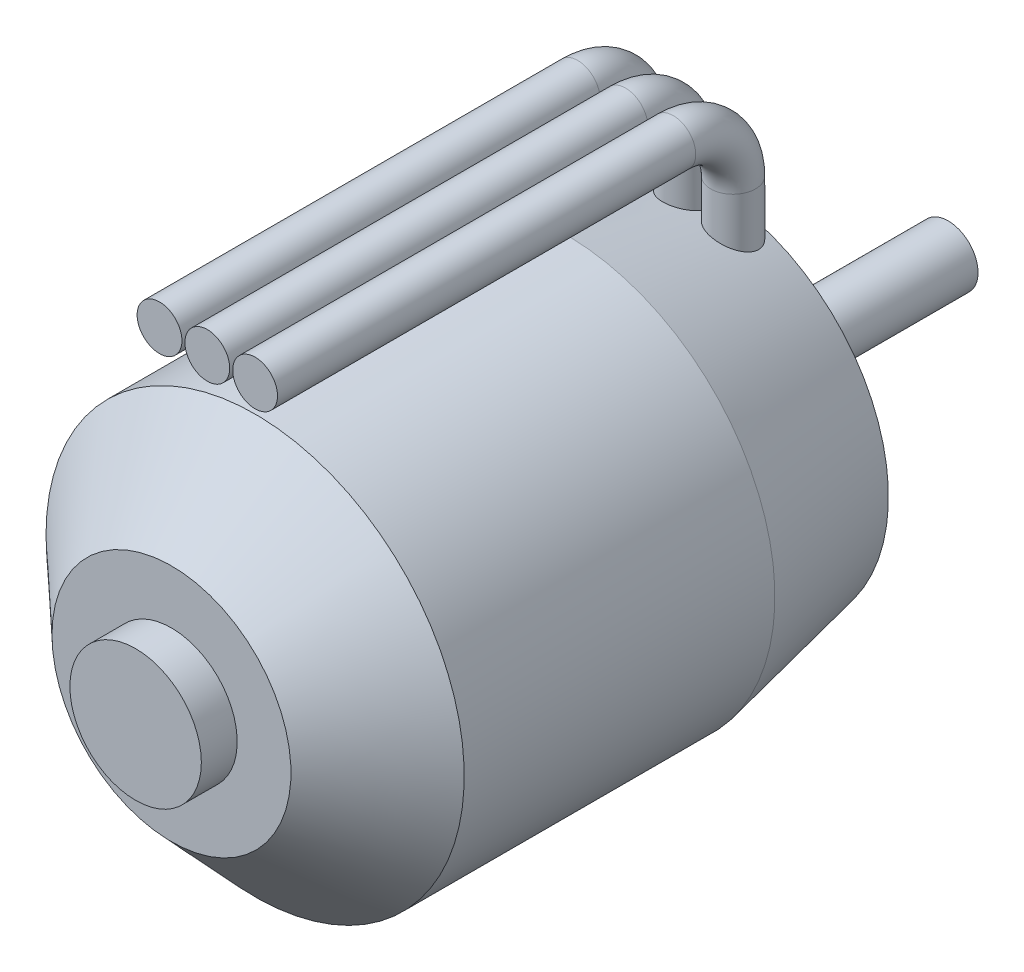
ISO-10303-21;
HEADER;
FILE_DESCRIPTION(('STEP AP214'),'2;1');
FILE_NAME('part.step','',(''),(''),'','','');
FILE_SCHEMA(('AUTOMOTIVE_DESIGN { 1 0 10303 214 1 1 1 1 }'));
ENDSEC;
DATA;
#1=APPLICATION_CONTEXT('core data for automotive mechanical design processes');
#2=APPLICATION_PROTOCOL_DEFINITION('international standard','automotive_design',2000,#1);
#3=PRODUCT_CONTEXT('',#1,'mechanical');
#4=PRODUCT('Part','Part','',(#3));
#5=PRODUCT_RELATED_PRODUCT_CATEGORY('part','',(#4));
#6=PRODUCT_DEFINITION_FORMATION('','',#4);
#7=PRODUCT_DEFINITION_CONTEXT('part definition',#1,'design');
#8=PRODUCT_DEFINITION('design','',#6,#7);
#9=PRODUCT_DEFINITION_SHAPE('','',#8);
#10=(LENGTH_UNIT() NAMED_UNIT(*) SI_UNIT(.MILLI.,.METRE.));
#11=(NAMED_UNIT(*) PLANE_ANGLE_UNIT() SI_UNIT($,.RADIAN.));
#12=(NAMED_UNIT(*) SI_UNIT($,.STERADIAN.) SOLID_ANGLE_UNIT());
#13=UNCERTAINTY_MEASURE_WITH_UNIT(LENGTH_MEASURE(1.E-05),#10,'distance_accuracy_value','');
#14=(GEOMETRIC_REPRESENTATION_CONTEXT(3) GLOBAL_UNCERTAINTY_ASSIGNED_CONTEXT((#13)) GLOBAL_UNIT_ASSIGNED_CONTEXT((#10,
#11,#12)) REPRESENTATION_CONTEXT('',''));
#15=CARTESIAN_POINT('',(0.,0.,0.));
#16=DIRECTION('',(0.,0.,1.));
#17=DIRECTION('',(1.,0.,0.));
#18=AXIS2_PLACEMENT_3D('',#15,#16,#17);
#19=CARTESIAN_POINT('',(0.,0.,-12.));
#20=DIRECTION('',(0.,0.,1.));
#21=DIRECTION('',(1.,0.,0.));
#22=AXIS2_PLACEMENT_3D('',#19,#20,#21);
#23=CONICAL_SURFACE('',#22,15.,0.205395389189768);
#24=CARTESIAN_POINT('',(-1.30324198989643,15.0796160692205,-11.3480301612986));
#25=CARTESIAN_POINT('',(-1.22807733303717,15.0709173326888,-11.4206913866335));
#26=CARTESIAN_POINT('',(-1.14669727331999,15.0635005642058,-11.4871701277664));
#27=CARTESIAN_POINT('',(-0.973804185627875,15.0509154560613,-11.6057206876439));
#28=CARTESIAN_POINT('',(-0.882280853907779,15.045749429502,-11.6577776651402));
#29=CARTESIAN_POINT('',(-0.691781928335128,15.037338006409,-11.7458713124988));
#30=CARTESIAN_POINT('',(-0.592809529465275,15.0340917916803,-11.7819148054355));
#31=CARTESIAN_POINT('',(-0.390216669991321,15.029244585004,-11.8369468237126));
#32=CARTESIAN_POINT('',(-0.286597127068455,15.0276432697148,-11.8559387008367));
#33=CARTESIAN_POINT('',(-0.0775942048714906,15.0259265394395,-11.8763346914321));
#34=CARTESIAN_POINT('',(0.0277897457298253,15.0258116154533,-11.8777329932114));
#35=CARTESIAN_POINT('',(0.237301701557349,15.0270570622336,-11.8628854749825));
#36=CARTESIAN_POINT('',(0.341429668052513,15.0284174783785,-11.8466391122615));
#37=CARTESIAN_POINT('',(0.545504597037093,15.0327504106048,-11.7969645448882));
#38=CARTESIAN_POINT('',(0.64545019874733,15.0357234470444,-11.7635307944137));
#39=CARTESIAN_POINT('',(0.838282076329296,15.0435407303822,-11.6804550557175));
#40=CARTESIAN_POINT('',(0.931168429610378,15.0483849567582,-11.6308132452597));
#41=CARTESIAN_POINT('',(1.10718859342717,15.0602717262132,-11.5168208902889));
#42=CARTESIAN_POINT('',(1.1903284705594,15.067312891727,-11.4524795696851));
#43=CARTESIAN_POINT('',(1.34457927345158,15.0839272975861,-11.3109861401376));
#44=CARTESIAN_POINT('',(1.41569047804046,15.0935004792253,-11.233834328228));
#45=CARTESIAN_POINT('',(1.54394656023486,15.1154407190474,-11.069000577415));
#46=CARTESIAN_POINT('',(1.60108735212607,15.1278085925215,-10.9813155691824));
#47=CARTESIAN_POINT('',(1.69988056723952,15.1554488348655,-10.7980412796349));
#48=CARTESIAN_POINT('',(1.74153269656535,15.1707212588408,-10.7024518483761));
#49=CARTESIAN_POINT('',(1.80861151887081,15.2042080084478,-10.5054292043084));
#50=CARTESIAN_POINT('',(1.83391659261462,15.2224431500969,-10.403958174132));
#51=CARTESIAN_POINT('',(1.86733935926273,15.2614599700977,-10.198706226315));
#52=CARTESIAN_POINT('',(1.87545532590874,15.2822419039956,-10.0949250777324));
#53=CARTESIAN_POINT('',(1.87449591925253,15.326243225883,-9.8858461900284));
#54=CARTESIAN_POINT('',(1.86508163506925,15.3495022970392,-9.78055842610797));
#55=CARTESIAN_POINT('',(1.82883776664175,15.3973390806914,-9.57333055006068));
#56=CARTESIAN_POINT('',(1.80200548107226,15.4219169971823,-9.4713909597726));
#57=CARTESIAN_POINT('',(1.73088855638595,15.4720370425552,-9.27116488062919));
#58=CARTESIAN_POINT('',(1.68620659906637,15.4975882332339,-9.17302158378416));
#59=CARTESIAN_POINT('',(1.58060843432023,15.547946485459,-8.9856692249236));
#60=CARTESIAN_POINT('',(1.51969068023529,15.5727534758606,-8.89646101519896));
#61=CARTESIAN_POINT('',(1.38275782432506,15.6205278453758,-8.72902997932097));
#62=CARTESIAN_POINT('',(1.30666069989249,15.643484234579,-8.65087096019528));
#63=CARTESIAN_POINT('',(1.14153413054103,15.686125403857,-8.50855830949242));
#64=CARTESIAN_POINT('',(1.05250661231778,15.7058106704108,-8.44440259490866));
#65=CARTESIAN_POINT('',(0.866596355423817,15.7402112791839,-8.33386601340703));
#66=CARTESIAN_POINT('',(0.770002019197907,15.7550499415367,-8.28703923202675));
#67=CARTESIAN_POINT('',(0.569664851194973,15.7795360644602,-8.210419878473));
#68=CARTESIAN_POINT('',(0.465924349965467,15.7891852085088,-8.18062178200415));
#69=CARTESIAN_POINT('',(0.259321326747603,15.8023256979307,-8.14017418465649));
#70=CARTESIAN_POINT('',(0.156633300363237,15.8060770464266,-8.12871573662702));
#71=CARTESIAN_POINT('',(-0.0492740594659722,15.8080037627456,-8.12282137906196));
#72=CARTESIAN_POINT('',(-0.152493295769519,15.8061801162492,-8.12838246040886));
#73=CARTESIAN_POINT('',(-0.353774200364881,15.7971963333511,-8.15594803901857));
#74=CARTESIAN_POINT('',(-0.451900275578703,15.7901730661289,-8.17753083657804));
#75=CARTESIAN_POINT('',(-0.643039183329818,15.7713787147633,-8.23588198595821));
#76=CARTESIAN_POINT('',(-0.736051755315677,15.7596073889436,-8.27265111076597));
#77=CARTESIAN_POINT('',(-0.915942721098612,15.7317821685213,-8.36083487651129));
#78=CARTESIAN_POINT('',(-1.00270571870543,15.7156656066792,-8.41246464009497));
#79=CARTESIAN_POINT('',(-1.16641342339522,15.6801149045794,-8.52854497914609));
#80=CARTESIAN_POINT('',(-1.24335615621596,15.6606800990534,-8.59299812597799));
#81=CARTESIAN_POINT('',(-1.38871897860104,15.6185834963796,-8.73591627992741));
#82=CARTESIAN_POINT('',(-1.45663938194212,15.5958198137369,-8.8148595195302));
#83=CARTESIAN_POINT('',(-1.5783671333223,15.5488492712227,-8.98258844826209));
#84=CARTESIAN_POINT('',(-1.63217141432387,15.5246420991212,-9.07137627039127));
#85=CARTESIAN_POINT('',(-1.72612643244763,15.4749463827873,-9.25998649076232));
#86=CARTESIAN_POINT('',(-1.76569221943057,15.4494437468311,-9.36009715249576));
#87=CARTESIAN_POINT('',(-1.82718127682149,15.3991444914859,-9.56577062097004));
#88=CARTESIAN_POINT('',(-1.84910388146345,15.3743478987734,-9.67133363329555));
#89=CARTESIAN_POINT('',(-1.87465828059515,15.326232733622,-9.88583911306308));
#90=CARTESIAN_POINT('',(-1.87815166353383,15.3029266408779,-9.99480098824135));
#91=CARTESIAN_POINT('',(-1.86613050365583,15.258768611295,-10.2122039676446));
#92=CARTESIAN_POINT('',(-1.85061389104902,15.2379169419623,-10.3206450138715));
#93=CARTESIAN_POINT('',(-1.8012472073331,15.1995632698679,-10.5316545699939));
#94=CARTESIAN_POINT('',(-1.76774867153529,15.182005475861,-10.6342952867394));
#95=CARTESIAN_POINT('',(-1.68343019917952,15.1500124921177,-10.8326281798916));
#96=CARTESIAN_POINT('',(-1.63263141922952,15.1355735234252,-10.9283286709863));
#97=CARTESIAN_POINT('',(-1.535304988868,15.1142119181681,-11.0786677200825));
#98=CARTESIAN_POINT('',(-1.4932738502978,15.1064087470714,-11.1361434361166));
#99=CARTESIAN_POINT('',(-1.40287263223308,15.0920770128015,-11.246047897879));
#100=CARTESIAN_POINT('',(-1.35450268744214,15.08554842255,-11.2984767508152));
#101=CARTESIAN_POINT('',(-1.30324198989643,15.0796160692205,-11.3480301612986));
#102=B_SPLINE_CURVE_WITH_KNOTS('',3,(#24,#25,#26,#27,#28,#29,#30,#31,#32,#33,#34,#35,#36,#37,
#38,#39,#40,#41,#42,#43,#44,#45,#46,#47,#48,#49,#50,#51,#52,#53,#54,#55,#56,#57,#58,#59,#60,#61,
#62,#63,#64,#65,#66,#67,#68,#69,#70,#71,#72,#73,#74,#75,#76,#77,#78,#79,#80,#81,#82,#83,#84,#85,
#86,#87,#88,#89,#90,#91,#92,#93,#94,#95,#96,#97,#98,#99,#100,#101),.UNSPECIFIED.,.T.,.F.,(4,2,2,
2,2,2,2,2,2,2,2,2,2,2,2,2,2,2,2,2,2,2,2,2,2,2,2,2,2,2,2,2,2,2,2,2,2,2,4),(0.,0.314454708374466,
0.629231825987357,0.943874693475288,1.25845569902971,1.57314061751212,1.88783521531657,
2.20263141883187,2.51742416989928,2.83201992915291,3.14660839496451,3.46128875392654,
3.77597508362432,4.09297645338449,4.41000965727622,4.73323575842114,5.05651200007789,
5.38742529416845,5.71837012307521,6.05115419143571,6.3838887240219,6.70734147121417,
7.03068922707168,7.33933694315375,7.64793009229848,7.94867668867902,8.24943859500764,
8.55479445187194,8.86021160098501,9.17857846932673,9.49701445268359,9.82734279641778,
10.1576836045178,10.4905019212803,10.8233564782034,11.1499290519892,11.4761036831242,
11.6905596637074,11.9050110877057),.UNSPECIFIED.);
#103=CARTESIAN_POINT('',(-1.30324198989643,15.0796160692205,-11.3480301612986));
#104=VERTEX_POINT('',#103);
#105=EDGE_CURVE('E174',#104,#104,#102,.T.);
#106=ORIENTED_EDGE('',*,*,#105,.T.);
#107=EDGE_LOOP('',(#106));
#108=FACE_BOUND('',#107,.T.);
#109=CARTESIAN_POINT('',(0.,0.,0.));
#110=DIRECTION('',(0.,0.,-1.));
#111=DIRECTION('',(-1.,0.,0.));
#112=AXIS2_PLACEMENT_3D('',#109,#110,#111);
#113=CIRCLE('',#112,17.5);
#114=CARTESIAN_POINT('',(-17.5,0.,0.));
#115=VERTEX_POINT('',#114);
#116=EDGE_CURVE('E160',#115,#115,#113,.T.);
#117=ORIENTED_EDGE('',*,*,#116,.T.);
#118=EDGE_LOOP('',(#117));
#119=FACE_BOUND('',#118,.T.);
#120=CARTESIAN_POINT('',(0.,0.,-12.));
#121=DIRECTION('',(0.,0.,-1.));
#122=DIRECTION('',(-1.,0.,0.));
#123=AXIS2_PLACEMENT_3D('',#120,#121,#122);
#124=CIRCLE('',#123,15.);
#125=CARTESIAN_POINT('',(-15.,0.,-12.));
#126=VERTEX_POINT('',#125);
#127=EDGE_CURVE('E153',#126,#126,#124,.T.);
#128=ORIENTED_EDGE('',*,*,#127,.F.);
#129=EDGE_LOOP('',(#128));
#130=FACE_BOUND('',#129,.T.);
#131=CARTESIAN_POINT('',(-5.37809344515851,14.1651981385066,-11.2714100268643));
#132=CARTESIAN_POINT('',(-5.30746011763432,14.1749557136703,-11.3479619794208));
#133=CARTESIAN_POINT('',(-5.23056754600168,14.1879261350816,-11.4184580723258));
#134=CARTESIAN_POINT('',(-5.0667938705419,14.2191565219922,-11.5454296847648));
#135=CARTESIAN_POINT('',(-4.97989476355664,14.2374261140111,-11.6018793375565));
#136=CARTESIAN_POINT('',(-4.79904999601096,14.2779830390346,-11.699310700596));
#137=CARTESIAN_POINT('',(-4.70512646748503,14.3002580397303,-11.7403387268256));
#138=CARTESIAN_POINT('',(-4.51258865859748,14.3477411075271,-11.8064443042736));
#139=CARTESIAN_POINT('',(-4.41397562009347,14.3729484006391,-11.8315260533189));
#140=CARTESIAN_POINT('',(-4.21017206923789,14.4264761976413,-11.8661703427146));
#141=CARTESIAN_POINT('',(-4.10488187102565,14.4548843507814,-11.8750118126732));
#142=CARTESIAN_POINT('',(-3.89464018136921,14.5129488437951,-11.8749881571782));
#143=CARTESIAN_POINT('',(-3.78968877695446,14.5426054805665,-11.8661187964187));
#144=CARTESIAN_POINT('',(-3.57918112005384,14.6035330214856,-11.8303915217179));
#145=CARTESIAN_POINT('',(-3.47373732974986,14.6348237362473,-11.8029019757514));
#146=CARTESIAN_POINT('',(-3.26918167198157,14.6974064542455,-11.7301204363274));
#147=CARTESIAN_POINT('',(-3.17007025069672,14.7286984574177,-11.6848271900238));
#148=CARTESIAN_POINT('',(-2.98009850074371,14.7911948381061,-11.5771699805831));
#149=CARTESIAN_POINT('',(-2.88933311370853,14.8223950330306,-11.5146358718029));
#150=CARTESIAN_POINT('',(-2.71999438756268,14.8840795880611,-11.3745136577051));
#151=CARTESIAN_POINT('',(-2.64142095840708,14.9145639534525,-11.2969256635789));
#152=CARTESIAN_POINT('',(-2.49922337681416,14.9744543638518,-11.1293029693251));
#153=CARTESIAN_POINT('',(-2.43554020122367,15.0038642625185,-11.0393197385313));
#154=CARTESIAN_POINT('',(-2.32477001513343,15.0614829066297,-10.8493067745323));
#155=CARTESIAN_POINT('',(-2.27768254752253,15.089691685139,-10.7492773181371));
#156=CARTESIAN_POINT('',(-2.20209846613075,15.1442869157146,-10.5432239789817));
#157=CARTESIAN_POINT('',(-2.17341159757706,15.1706894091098,-10.4372741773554));
#158=CARTESIAN_POINT('',(-2.13491269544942,15.2215422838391,-10.2215357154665));
#159=CARTESIAN_POINT('',(-2.1250996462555,15.2459927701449,-10.1117472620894));
#160=CARTESIAN_POINT('',(-2.12490353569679,15.2919308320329,-9.89347882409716));
#161=CARTESIAN_POINT('',(-2.13419264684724,15.3134617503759,-9.78500836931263));
#162=CARTESIAN_POINT('',(-2.17156456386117,15.3532931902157,-9.57073219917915));
#163=CARTESIAN_POINT('',(-2.19964496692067,15.3715941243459,-9.46492614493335));
#164=CARTESIAN_POINT('',(-2.27301500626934,15.4036208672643,-9.26213176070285));
#165=CARTESIAN_POINT('',(-2.31780165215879,15.4174602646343,-9.16497962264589));
#166=CARTESIAN_POINT('',(-2.42355223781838,15.4403494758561,-8.97929261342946));
#167=CARTESIAN_POINT('',(-2.48451203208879,15.4494005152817,-8.89075554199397));
#168=CARTESIAN_POINT('',(-2.61826502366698,15.4615994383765,-8.72835888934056));
#169=CARTESIAN_POINT('',(-2.69051155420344,15.4649614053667,-8.65406511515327));
#170=CARTESIAN_POINT('',(-2.84626872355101,15.4657951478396,-8.51838318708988));
#171=CARTESIAN_POINT('',(-2.92977644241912,15.4632684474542,-8.45699169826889));
#172=CARTESIAN_POINT('',(-3.10254530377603,15.452099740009,-8.35071234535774));
#173=CARTESIAN_POINT('',(-3.19152776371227,15.4436611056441,-8.30534906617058));
#174=CARTESIAN_POINT('',(-3.37488433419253,15.4208086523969,-8.22949210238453));
#175=CARTESIAN_POINT('',(-3.46925815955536,15.4063951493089,-8.19899763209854));
#176=CARTESIAN_POINT('',(-3.66063444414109,15.3718252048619,-8.15334378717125));
#177=CARTESIAN_POINT('',(-3.75763769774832,15.3516670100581,-8.13818910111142));
#178=CARTESIAN_POINT('',(-3.95158799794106,15.3061378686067,-8.12310118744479));
#179=CARTESIAN_POINT('',(-4.04853503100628,15.2807659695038,-8.12317074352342));
#180=CARTESIAN_POINT('',(-4.24457607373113,15.2242356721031,-8.13829919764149));
#181=CARTESIAN_POINT('',(-4.34355084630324,15.1928584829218,-8.1540751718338));
#182=CARTESIAN_POINT('',(-4.53652126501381,15.1262288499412,-8.20065761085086));
#183=CARTESIAN_POINT('',(-4.63051520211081,15.0909750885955,-8.23146919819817));
#184=CARTESIAN_POINT('',(-4.81891317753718,15.014755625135,-8.30995893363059));
#185=CARTESIAN_POINT('',(-4.9127412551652,14.9735585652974,-8.35879506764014));
#186=CARTESIAN_POINT('',(-5.09037373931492,14.8894004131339,-8.47102665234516));
#187=CARTESIAN_POINT('',(-5.17417399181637,14.8464385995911,-8.53442810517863));
#188=CARTESIAN_POINT('',(-5.33551372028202,14.7572000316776,-8.67917245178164));
#189=CARTESIAN_POINT('',(-5.41219149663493,14.7109036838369,-8.76146698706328));
#190=CARTESIAN_POINT('',(-5.55001063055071,14.6199112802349,-8.93899859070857));
#191=CARTESIAN_POINT('',(-5.61114802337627,14.5752156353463,-9.03423895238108));
#192=CARTESIAN_POINT('',(-5.7162021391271,14.4891086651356,-9.23624043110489));
#193=CARTESIAN_POINT('',(-5.75998590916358,14.4477245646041,-9.34308279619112));
#194=CARTESIAN_POINT('',(-5.82749661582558,14.3707703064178,-9.56491484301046));
#195=CARTESIAN_POINT('',(-5.85123490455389,14.3351968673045,-9.67989987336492));
#196=CARTESIAN_POINT('',(-5.8757987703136,14.2743044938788,-9.90561492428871));
#197=CARTESIAN_POINT('',(-5.87821060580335,14.248416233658,-10.0160163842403));
#198=CARTESIAN_POINT('',(-5.86323656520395,14.2047675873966,-10.2371102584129));
#199=CARTESIAN_POINT('',(-5.84586161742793,14.1870027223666,-10.3478024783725));
#200=CARTESIAN_POINT('',(-5.79401629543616,14.1617651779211,-10.5543676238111));
#201=CARTESIAN_POINT('',(-5.76143224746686,14.1534399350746,-10.650614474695));
#202=CARTESIAN_POINT('',(-5.68097965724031,14.144138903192,-10.8367658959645));
#203=CARTESIAN_POINT('',(-5.63313496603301,14.1431517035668,-10.9266800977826));
#204=CARTESIAN_POINT('',(-5.5488697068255,14.1469426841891,-11.0581335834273));
#205=CARTESIAN_POINT('',(-5.51728598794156,14.1492824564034,-11.1029331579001));
#206=CARTESIAN_POINT('',(-5.45040539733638,14.1558535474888,-11.18951266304));
#207=CARTESIAN_POINT('',(-5.41510890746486,14.160084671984,-11.2312929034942));
#208=CARTESIAN_POINT('',(-5.37809344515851,14.1651981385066,-11.2714100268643));
#209=B_SPLINE_CURVE_WITH_KNOTS('',3,(#131,#132,#133,#134,#135,#136,#137,#138,#139,#140,#141,
#142,#143,#144,#145,#146,#147,#148,#149,#150,#151,#152,#153,#154,#155,#156,#157,#158,#159,#160,
#161,#162,#163,#164,#165,#166,#167,#168,#169,#170,#171,#172,#173,#174,#175,#176,#177,#178,#179,
#180,#181,#182,#183,#184,#185,#186,#187,#188,#189,#190,#191,#192,#193,#194,#195,#196,#197,#198,
#199,#200,#201,#202,#203,#204,#205,#206,#207,#208),.UNSPECIFIED.,.T.,.F.,(4,2,2,2,2,2,2,2,2,2,2,
2,2,2,2,2,2,2,2,2,2,2,2,2,2,2,2,2,2,2,2,2,2,2,2,2,2,2,4),(0.,0.313632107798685,
0.627837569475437,0.941091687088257,1.25426330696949,1.58103177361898,1.90787839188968,
2.24640745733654,2.58496034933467,2.92698192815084,3.26900098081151,3.60964041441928,
3.95027046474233,4.28731921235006,4.62434982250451,4.95564467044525,5.28689716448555,
5.60889016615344,5.93080071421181,6.24030362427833,6.54972643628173,6.84899661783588,
7.14825098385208,7.44759678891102,7.74699732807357,8.06072409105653,8.37455781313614,
8.71365237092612,9.05288691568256,9.41610886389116,9.77942338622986,10.1454699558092,
10.5113090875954,10.8496850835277,11.1878742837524,11.4921946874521,11.7960417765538,
11.9604178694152,12.124777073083),.UNSPECIFIED.);
#210=CARTESIAN_POINT('',(-5.37809344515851,14.1651981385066,-11.2714100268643));
#211=VERTEX_POINT('',#210);
#212=EDGE_CURVE('E83',#211,#211,#209,.T.);
#213=ORIENTED_EDGE('',*,*,#212,.T.);
#214=EDGE_LOOP('',(#213));
#215=FACE_BOUND('',#214,.T.);
#216=CARTESIAN_POINT('',(2.71356064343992,14.8871984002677,-11.3640743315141));
#217=CARTESIAN_POINT('',(2.7933818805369,14.8567082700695,-11.4393455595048));
#218=CARTESIAN_POINT('',(2.87980058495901,14.8257939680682,-11.5075718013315));
#219=CARTESIAN_POINT('',(3.0631545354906,14.7634027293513,-11.627881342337));
#220=CARTESIAN_POINT('',(3.16010255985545,14.7319251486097,-11.6799447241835));
#221=CARTESIAN_POINT('',(3.3614928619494,14.6688171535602,-11.7663315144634));
#222=CARTESIAN_POINT('',(3.46593056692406,14.6371868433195,-11.800665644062));
#223=CARTESIAN_POINT('',(3.67927088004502,14.5742906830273,-11.8506107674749));
#224=CARTESIAN_POINT('',(3.78817253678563,14.5430247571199,-11.866225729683));
#225=CARTESIAN_POINT('',(4.00743744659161,14.4815506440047,-11.8782000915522));
#226=CARTESIAN_POINT('',(4.11780189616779,14.4513434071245,-11.8745426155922));
#227=CARTESIAN_POINT('',(4.33673176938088,14.3929769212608,-11.847808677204));
#228=CARTESIAN_POINT('',(4.44529711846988,14.3648177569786,-11.8247314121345));
#229=CARTESIAN_POINT('',(4.65563051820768,14.312197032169,-11.7600226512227));
#230=CARTESIAN_POINT('',(4.75748141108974,14.287681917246,-11.7187050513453));
#231=CARTESIAN_POINT('',(4.95316474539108,14.2431568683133,-11.6183879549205));
#232=CARTESIAN_POINT('',(5.04699929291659,14.2231457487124,-11.559393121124));
#233=CARTESIAN_POINT('',(5.21939030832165,14.1898832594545,-11.4282488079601));
#234=CARTESIAN_POINT('',(5.29845269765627,14.1763620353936,-11.3568340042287));
#235=CARTESIAN_POINT('',(5.44369403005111,14.155988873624,-11.2011205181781));
#236=CARTESIAN_POINT('',(5.50987953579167,14.1491335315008,-11.1168284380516));
#237=CARTESIAN_POINT('',(5.62331227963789,14.1432521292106,-10.9436700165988));
#238=CARTESIAN_POINT('',(5.67149202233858,14.1437586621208,-10.8554294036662));
#239=CARTESIAN_POINT('',(5.75303827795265,14.1518956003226,-10.672671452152));
#240=CARTESIAN_POINT('',(5.78640850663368,14.1595242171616,-10.5781556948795));
#241=CARTESIAN_POINT('',(5.83671320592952,14.1814725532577,-10.3890566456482));
#242=CARTESIAN_POINT('',(5.8541608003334,14.1955595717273,-10.2945816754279));
#243=CARTESIAN_POINT('',(5.87446872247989,14.2298622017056,-10.1051956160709));
#244=CARTESIAN_POINT('',(5.87732734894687,14.2500785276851,-10.0102844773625));
#245=CARTESIAN_POINT('',(5.86879981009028,14.2966123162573,-9.81930074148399));
#246=CARTESIAN_POINT('',(5.85693758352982,14.3231100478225,-9.72329419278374));
#247=CARTESIAN_POINT('',(5.81909365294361,14.3807262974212,-9.5355618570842));
#248=CARTESIAN_POINT('',(5.79310712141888,14.4118463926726,-9.44383754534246));
#249=CARTESIAN_POINT('',(5.7252753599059,14.4804345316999,-9.25864431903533));
#250=CARTESIAN_POINT('',(5.68223717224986,14.5182200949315,-9.16573044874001));
#251=CARTESIAN_POINT('',(5.58228392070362,14.5963936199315,-8.98889640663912));
#252=CARTESIAN_POINT('',(5.52536268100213,14.6367827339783,-8.90498026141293));
#253=CARTESIAN_POINT('',(5.3933346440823,14.72247924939,-8.74049426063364));
#254=CARTESIAN_POINT('',(5.31704053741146,14.7678985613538,-8.66093289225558));
#255=CARTESIAN_POINT('',(5.15158028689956,14.8583380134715,-8.51622966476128));
#256=CARTESIAN_POINT('',(5.06240984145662,14.9033580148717,-8.45109264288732));
#257=CARTESIAN_POINT('',(4.86993176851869,14.9927931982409,-8.33509805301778));
#258=CARTESIAN_POINT('',(4.76624051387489,15.0371329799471,-8.28481544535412));
#259=CARTESIAN_POINT('',(4.54989115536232,15.1216420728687,-8.20373222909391));
#260=CARTESIAN_POINT('',(4.43723513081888,15.1618123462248,-8.17292711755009));
#261=CARTESIAN_POINT('',(4.21161234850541,15.2344783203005,-8.13362913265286));
#262=CARTESIAN_POINT('',(4.09890334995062,15.2672439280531,-8.12416585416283));
#263=CARTESIAN_POINT('',(3.87189024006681,15.3260041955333,-8.12594787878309));
#264=CARTESIAN_POINT('',(3.75758722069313,15.3520032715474,-8.13717963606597));
#265=CARTESIAN_POINT('',(3.54136277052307,15.3943263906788,-8.17891931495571));
#266=CARTESIAN_POINT('',(3.43922721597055,15.411293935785,-8.20767111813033));
#267=CARTESIAN_POINT('',(3.24051749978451,15.4383846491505,-8.28242489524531));
#268=CARTESIAN_POINT('',(3.14394112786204,15.4485105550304,-8.328419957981));
#269=CARTESIAN_POINT('',(2.96533755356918,15.4615489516,-8.43310596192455));
#270=CARTESIAN_POINT('',(2.88278181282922,15.4648646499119,-8.49084864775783));
#271=CARTESIAN_POINT('',(2.7279700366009,15.4658510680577,-8.61882381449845));
#272=CARTESIAN_POINT('',(2.65571319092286,15.4635222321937,-8.68905531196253));
#273=CARTESIAN_POINT('',(2.5240586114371,15.4538314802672,-8.83934327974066));
#274=CARTESIAN_POINT('',(2.46456090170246,15.4465107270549,-8.91931503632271));
#275=CARTESIAN_POINT('',(2.3591429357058,15.4275632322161,-9.08728518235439));
#276=CARTESIAN_POINT('',(2.31322422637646,15.4159360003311,-9.17528448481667));
#277=CARTESIAN_POINT('',(2.23485274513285,15.388707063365,-9.35954134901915));
#278=CARTESIAN_POINT('',(2.20282268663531,15.3730011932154,-9.45596312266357));
#279=CARTESIAN_POINT('',(2.15477511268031,15.3385304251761,-9.65218139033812));
#280=CARTESIAN_POINT('',(2.13875983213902,15.3197651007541,-9.75197835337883));
#281=CARTESIAN_POINT('',(2.12261084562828,15.2790596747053,-9.9561907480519));
#282=CARTESIAN_POINT('',(2.12310553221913,15.2570258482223,-10.0606372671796));
#283=CARTESIAN_POINT('',(2.14128695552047,15.21094425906,-10.2675951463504));
#284=CARTESIAN_POINT('',(2.15898010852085,15.1868957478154,-10.3701057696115));
#285=CARTESIAN_POINT('',(2.21169845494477,15.1364709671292,-10.5735765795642));
#286=CARTESIAN_POINT('',(2.24724633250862,15.1100455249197,-10.6743890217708));
#287=CARTESIAN_POINT('',(2.3347131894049,15.0559241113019,-10.8681735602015));
#288=CARTESIAN_POINT('',(2.38661580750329,15.0282294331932,-10.9611533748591));
#289=CARTESIAN_POINT('',(2.48455681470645,14.9816249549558,-11.1062790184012));
#290=CARTESIAN_POINT('',(2.52638914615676,14.9629985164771,-11.161405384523));
#291=CARTESIAN_POINT('',(2.61579853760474,14.9253700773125,-11.2666409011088));
#292=CARTESIAN_POINT('',(2.66337564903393,14.9063680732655,-11.3167500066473));
#293=CARTESIAN_POINT('',(2.71356064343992,14.8871984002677,-11.3640743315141));
#294=B_SPLINE_CURVE_WITH_KNOTS('',3,(#216,#217,#218,#219,#220,#221,#222,#223,#224,#225,#226,
#227,#228,#229,#230,#231,#232,#233,#234,#235,#236,#237,#238,#239,#240,#241,#242,#243,#244,#245,
#246,#247,#248,#249,#250,#251,#252,#253,#254,#255,#256,#257,#258,#259,#260,#261,#262,#263,#264,
#265,#266,#267,#268,#269,#270,#271,#272,#273,#274,#275,#276,#277,#278,#279,#280,#281,#282,#283,
#284,#285,#286,#287,#288,#289,#290,#291,#292,#293),.UNSPECIFIED.,.T.,.F.,(4,2,2,2,2,2,2,2,2,2,2,
2,2,2,2,2,2,2,2,2,2,2,2,2,2,2,2,2,2,2,2,2,2,2,2,2,2,2,4),(0.,0.341354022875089,
0.683127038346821,1.02469313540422,1.36618680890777,1.70797955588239,2.04978643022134,
2.38592750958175,2.72198000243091,3.04248862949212,3.36283347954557,3.66293353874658,
3.96295825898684,4.25293266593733,4.5429408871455,4.84257704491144,5.14231567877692,
5.46839498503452,5.7946196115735,6.15068916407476,6.50687794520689,6.87544603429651,
7.24392888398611,7.59528686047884,7.94641493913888,8.26709281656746,8.58764230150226,
8.88859172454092,9.18951745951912,9.48799132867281,9.78649918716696,10.0935448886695,
10.4006334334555,10.7194230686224,11.0383316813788,11.3671734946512,11.6956873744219,
11.9103006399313,12.1249158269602),.UNSPECIFIED.);
#295=CARTESIAN_POINT('',(2.71356064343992,14.8871984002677,-11.3640743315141));
#296=VERTEX_POINT('',#295);
#297=EDGE_CURVE('E44',#296,#296,#294,.T.);
#298=ORIENTED_EDGE('',*,*,#297,.T.);
#299=EDGE_LOOP('',(#298));
#300=FACE_BOUND('',#299,.T.);
#301=ADVANCED_FACE('F40',(#108,#119,#130,#215,#300),#23,.T.);
#302=CARTESIAN_POINT('',(0.,0.,-13.));
#303=DIRECTION('',(0.,0.,-1.));
#304=DIRECTION('',(-1.,0.,0.));
#305=AXIS2_PLACEMENT_3D('',#302,#303,#304);
#306=PLANE('',#305);
#307=CARTESIAN_POINT('',(0.,0.,-13.));
#308=DIRECTION('',(0.,0.,-1.));
#309=DIRECTION('',(-1.,0.,0.));
#310=AXIS2_PLACEMENT_3D('',#307,#308,#309);
#311=CIRCLE('',#310,3.5);
#312=CARTESIAN_POINT('',(-3.5,0.,-13.));
#313=VERTEX_POINT('',#312);
#314=EDGE_CURVE('E108',#313,#313,#311,.T.);
#315=ORIENTED_EDGE('',*,*,#314,.T.);
#316=EDGE_LOOP('',(#315));
#317=FACE_BOUND('',#316,.T.);
#318=CARTESIAN_POINT('',(0.,0.,-13.));
#319=DIRECTION('',(0.,0.,-1.));
#320=DIRECTION('',(-1.,0.,0.));
#321=AXIS2_PLACEMENT_3D('',#318,#319,#320);
#322=CIRCLE('',#321,2.5);
#323=CARTESIAN_POINT('',(-2.5,0.,-13.));
#324=VERTEX_POINT('',#323);
#325=EDGE_CURVE('E101',#324,#324,#322,.T.);
#326=ORIENTED_EDGE('',*,*,#325,.F.);
#327=EDGE_LOOP('',(#326));
#328=FACE_BOUND('',#327,.T.);
#329=ADVANCED_FACE('F143',(#317,#328),#306,.T.);
#330=CARTESIAN_POINT('',(0.,0.,-12.));
#331=DIRECTION('',(0.,0.,-1.));
#332=DIRECTION('',(-1.,0.,0.));
#333=AXIS2_PLACEMENT_3D('',#330,#331,#332);
#334=PLANE('',#333);
#335=CARTESIAN_POINT('',(8.83883476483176,8.83883476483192,-12.));
#336=DIRECTION('',(0.,0.,-1.));
#337=DIRECTION('',(-1.,0.,0.));
#338=AXIS2_PLACEMENT_3D('',#335,#336,#337);
#339=CIRCLE('',#338,1.24999999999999);
#340=CARTESIAN_POINT('',(7.58883476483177,8.83883476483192,-12.));
#341=VERTEX_POINT('',#340);
#342=EDGE_CURVE('E77',#341,#341,#339,.T.);
#343=ORIENTED_EDGE('',*,*,#342,.F.);
#344=EDGE_LOOP('',(#343));
#345=FACE_BOUND('',#344,.T.);
#346=CARTESIAN_POINT('',(-8.83883476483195,8.83883476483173,-12.));
#347=DIRECTION('',(0.,0.,-1.));
#348=DIRECTION('',(-1.,0.,0.));
#349=AXIS2_PLACEMENT_3D('',#346,#347,#348);
#350=CIRCLE('',#349,1.24999999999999);
#351=CARTESIAN_POINT('',(-10.0888347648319,8.83883476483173,-12.));
#352=VERTEX_POINT('',#351);
#353=EDGE_CURVE('E76',#352,#352,#350,.T.);
#354=ORIENTED_EDGE('',*,*,#353,.F.);
#355=EDGE_LOOP('',(#354));
#356=FACE_BOUND('',#355,.T.);
#357=CARTESIAN_POINT('',(-8.83883476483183,-8.83883476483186,-12.));
#358=DIRECTION('',(0.,0.,-1.));
#359=DIRECTION('',(-1.,0.,0.));
#360=AXIS2_PLACEMENT_3D('',#357,#358,#359);
#361=CIRCLE('',#360,1.24999999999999);
#362=CARTESIAN_POINT('',(-10.0888347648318,-8.83883476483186,-12.));
#363=VERTEX_POINT('',#362);
#364=EDGE_CURVE('E89',#363,#363,#361,.T.);
#365=ORIENTED_EDGE('',*,*,#364,.F.);
#366=EDGE_LOOP('',(#365));
#367=FACE_BOUND('',#366,.T.);
#368=CARTESIAN_POINT('',(8.83883476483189,-8.83883476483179,-12.));
#369=DIRECTION('',(0.,0.,-1.));
#370=DIRECTION('',(-1.,0.,0.));
#371=AXIS2_PLACEMENT_3D('',#368,#369,#370);
#372=CIRCLE('',#371,1.24999999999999);
#373=CARTESIAN_POINT('',(7.5888347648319,-8.83883476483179,-12.));
#374=VERTEX_POINT('',#373);
#375=EDGE_CURVE('E95',#374,#374,#372,.T.);
#376=ORIENTED_EDGE('',*,*,#375,.F.);
#377=EDGE_LOOP('',(#376));
#378=FACE_BOUND('',#377,.T.);
#379=ORIENTED_EDGE('',*,*,#127,.T.);
#380=EDGE_LOOP('',(#379));
#381=FACE_BOUND('',#380,.T.);
#382=CARTESIAN_POINT('',(0.,0.,-12.));
#383=DIRECTION('',(0.,0.,-1.));
#384=DIRECTION('',(-1.,0.,0.));
#385=AXIS2_PLACEMENT_3D('',#382,#383,#384);
#386=CIRCLE('',#385,3.5);
#387=CARTESIAN_POINT('',(-3.5,0.,-12.));
#388=VERTEX_POINT('',#387);
#389=EDGE_CURVE('E105',#388,#388,#386,.T.);
#390=ORIENTED_EDGE('',*,*,#389,.F.);
#391=EDGE_LOOP('',(#390));
#392=FACE_BOUND('',#391,.T.);
#393=ADVANCED_FACE('F140',(#345,#356,#367,#378,#381,#392),#334,.T.);
#394=CARTESIAN_POINT('',(0.,0.,33.));
#395=DIRECTION('',(0.,0.,-1.));
#396=DIRECTION('',(-1.,0.,0.));
#397=AXIS2_PLACEMENT_3D('',#394,#395,#396);
#398=PLANE('',#397);
#399=CARTESIAN_POINT('',(0.,0.,33.));
#400=DIRECTION('',(0.,0.,-1.));
#401=DIRECTION('',(-1.,0.,0.));
#402=AXIS2_PLACEMENT_3D('',#399,#400,#401);
#403=CIRCLE('',#402,10.);
#404=CARTESIAN_POINT('',(-10.,0.,33.));
#405=VERTEX_POINT('',#404);
#406=EDGE_CURVE('E116',#405,#405,#403,.T.);
#407=ORIENTED_EDGE('',*,*,#406,.F.);
#408=EDGE_LOOP('',(#407));
#409=FACE_BOUND('',#408,.T.);
#410=CARTESIAN_POINT('',(0.,0.,33.));
#411=DIRECTION('',(0.,0.,-1.));
#412=DIRECTION('',(-1.,0.,0.));
#413=AXIS2_PLACEMENT_3D('',#410,#411,#412);
#414=CIRCLE('',#413,5.5);
#415=CARTESIAN_POINT('',(-5.5,0.,33.));
#416=VERTEX_POINT('',#415);
#417=EDGE_CURVE('E12',#416,#416,#414,.F.);
#418=ORIENTED_EDGE('',*,*,#417,.F.);
#419=EDGE_LOOP('',(#418));
#420=FACE_BOUND('',#419,.T.);
#421=ADVANCED_FACE('F137',(#409,#420),#398,.F.);
#422=CARTESIAN_POINT('',(0.,0.,26.));
#423=DIRECTION('',(0.,0.,-1.));
#424=DIRECTION('',(-1.,0.,0.));
#425=AXIS2_PLACEMENT_3D('',#422,#423,#424);
#426=CYLINDRICAL_SURFACE('',#425,17.5);
#427=CARTESIAN_POINT('',(0.,0.,26.));
#428=DIRECTION('',(0.,0.,-1.));
#429=DIRECTION('',(-1.,0.,0.));
#430=AXIS2_PLACEMENT_3D('',#427,#428,#429);
#431=CIRCLE('',#430,17.5);
#432=CARTESIAN_POINT('',(-17.5,0.,26.));
#433=VERTEX_POINT('',#432);
#434=EDGE_CURVE('E52',#433,#433,#431,.F.);
#435=CARTESIAN_POINT('',(-17.5,0.,26.));
#436=CARTESIAN_POINT('',(-17.5,0.,25.7291666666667));
#437=CARTESIAN_POINT('',(-17.5,0.,25.4583333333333));
#438=CARTESIAN_POINT('',(-17.5,0.,24.9166666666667));
#439=CARTESIAN_POINT('',(-17.5,0.,24.6458333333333));
#440=CARTESIAN_POINT('',(-17.5,0.,24.1041666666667));
#441=CARTESIAN_POINT('',(-17.5,0.,23.8333333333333));
#442=CARTESIAN_POINT('',(-17.5,0.,23.2916666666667));
#443=CARTESIAN_POINT('',(-17.5,0.,23.0208333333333));
#444=CARTESIAN_POINT('',(-17.5,0.,22.4791666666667));
#445=CARTESIAN_POINT('',(-17.5,0.,22.2083333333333));
#446=CARTESIAN_POINT('',(-17.5,0.,21.6666666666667));
#447=CARTESIAN_POINT('',(-17.5,0.,21.3958333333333));
#448=CARTESIAN_POINT('',(-17.5,0.,20.8541666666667));
#449=CARTESIAN_POINT('',(-17.5,0.,20.5833333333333));
#450=CARTESIAN_POINT('',(-17.5,0.,20.0416666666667));
#451=CARTESIAN_POINT('',(-17.5,0.,19.7708333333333));
#452=CARTESIAN_POINT('',(-17.5,0.,19.2291666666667));
#453=CARTESIAN_POINT('',(-17.5,0.,18.9583333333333));
#454=CARTESIAN_POINT('',(-17.5,0.,18.4166666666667));
#455=CARTESIAN_POINT('',(-17.5,0.,18.1458333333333));
#456=CARTESIAN_POINT('',(-17.5,0.,17.6041666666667));
#457=CARTESIAN_POINT('',(-17.5,0.,17.3333333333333));
#458=CARTESIAN_POINT('',(-17.5,0.,16.7916666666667));
#459=CARTESIAN_POINT('',(-17.5,0.,16.5208333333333));
#460=CARTESIAN_POINT('',(-17.5,0.,15.9791666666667));
#461=CARTESIAN_POINT('',(-17.5,0.,15.7083333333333));
#462=CARTESIAN_POINT('',(-17.5,0.,15.1666666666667));
#463=CARTESIAN_POINT('',(-17.5,0.,14.8958333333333));
#464=CARTESIAN_POINT('',(-17.5,0.,14.3541666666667));
#465=CARTESIAN_POINT('',(-17.5,0.,14.0833333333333));
#466=CARTESIAN_POINT('',(-17.5,0.,13.5416666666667));
#467=CARTESIAN_POINT('',(-17.5,0.,13.2708333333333));
#468=CARTESIAN_POINT('',(-17.5,0.,12.7291666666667));
#469=CARTESIAN_POINT('',(-17.5,0.,12.4583333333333));
#470=CARTESIAN_POINT('',(-17.5,0.,11.9166666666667));
#471=CARTESIAN_POINT('',(-17.5,0.,11.6458333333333));
#472=CARTESIAN_POINT('',(-17.5,0.,11.1041666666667));
#473=CARTESIAN_POINT('',(-17.5,0.,10.8333333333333));
#474=CARTESIAN_POINT('',(-17.5,0.,10.2916666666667));
#475=CARTESIAN_POINT('',(-17.5,0.,10.0208333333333));
#476=CARTESIAN_POINT('',(-17.5,0.,9.47916666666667));
#477=CARTESIAN_POINT('',(-17.5,0.,9.20833333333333));
#478=CARTESIAN_POINT('',(-17.5,0.,8.66666666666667));
#479=CARTESIAN_POINT('',(-17.5,0.,8.39583333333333));
#480=CARTESIAN_POINT('',(-17.5,0.,7.85416666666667));
#481=CARTESIAN_POINT('',(-17.5,0.,7.58333333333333));
#482=CARTESIAN_POINT('',(-17.5,0.,7.04166666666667));
#483=CARTESIAN_POINT('',(-17.5,0.,6.77083333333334));
#484=CARTESIAN_POINT('',(-17.5,0.,6.22916666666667));
#485=CARTESIAN_POINT('',(-17.5,0.,5.95833333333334));
#486=CARTESIAN_POINT('',(-17.5,0.,5.41666666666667));
#487=CARTESIAN_POINT('',(-17.5,0.,5.14583333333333));
#488=CARTESIAN_POINT('',(-17.5,0.,4.60416666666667));
#489=CARTESIAN_POINT('',(-17.5,0.,4.33333333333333));
#490=CARTESIAN_POINT('',(-17.5,0.,3.79166666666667));
#491=CARTESIAN_POINT('',(-17.5,0.,3.52083333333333));
#492=CARTESIAN_POINT('',(-17.5,0.,2.97916666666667));
#493=CARTESIAN_POINT('',(-17.5,0.,2.70833333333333));
#494=CARTESIAN_POINT('',(-17.5,0.,2.16666666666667));
#495=CARTESIAN_POINT('',(-17.5,0.,1.89583333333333));
#496=CARTESIAN_POINT('',(-17.5,0.,1.35416666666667));
#497=CARTESIAN_POINT('',(-17.5,0.,1.08333333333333));
#498=CARTESIAN_POINT('',(-17.5,0.,0.541666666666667));
#499=CARTESIAN_POINT('',(-17.5,0.,0.270833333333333));
#500=CARTESIAN_POINT('',(-17.5,0.,0.));
#501=B_SPLINE_CURVE_WITH_KNOTS('',3,(#435,#436,#437,#438,#439,#440,#441,#442,#443,#444,#445,
#446,#447,#448,#449,#450,#451,#452,#453,#454,#455,#456,#457,#458,#459,#460,#461,#462,#463,#464,
#465,#466,#467,#468,#469,#470,#471,#472,#473,#474,#475,#476,#477,#478,#479,#480,#481,#482,#483,
#484,#485,#486,#487,#488,#489,#490,#491,#492,#493,#494,#495,#496,#497,#498,#499,#500),
.UNSPECIFIED.,.F.,.F.,(4,2,2,2,2,2,2,2,2,2,2,2,2,2,2,2,2,2,2,2,2,2,2,2,2,2,2,2,2,2,2,2,4),(0.,
0.812500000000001,1.625,2.4375,3.25,4.0625,4.875,5.6875,6.5,7.3125,8.125,8.9375,9.75,10.5625,
11.375,12.1875,13.,13.8125,14.625,15.4375,16.25,17.0625,17.875,18.6875,19.5,20.3125,21.125,
21.9375,22.75,23.5625,24.375,25.1875,26.),.UNSPECIFIED.);
#502=EDGE_CURVE('BSEAM42',#433,#115,#501,.T.);
#503=ORIENTED_EDGE('',*,*,#434,.F.);
#504=ORIENTED_EDGE('',*,*,#116,.F.);
#505=ORIENTED_EDGE('',*,*,#502,.T.);
#506=ORIENTED_EDGE('',*,*,#502,.F.);
#507=EDGE_LOOP('',(#503,#505,#504,#506));
#508=FACE_BOUND('',#507,.T.);
#509=ADVANCED_FACE('F42',(#508),#426,.T.);
#510=CARTESIAN_POINT('',(0.,0.,33.));
#511=DIRECTION('',(0.,0.,-1.));
#512=DIRECTION('',(-1.,0.,0.));
#513=AXIS2_PLACEMENT_3D('',#510,#511,#512);
#514=CONICAL_SURFACE('',#513,10.,0.819867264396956);
#515=ORIENTED_EDGE('',*,*,#406,.T.);
#516=EDGE_LOOP('',(#515));
#517=FACE_BOUND('',#516,.T.);
#518=ORIENTED_EDGE('',*,*,#434,.T.);
#519=EDGE_LOOP('',(#518));
#520=FACE_BOUND('',#519,.T.);
#521=ADVANCED_FACE('F126',(#517,#520),#514,.T.);
#522=CARTESIAN_POINT('',(0.,0.,36.));
#523=DIRECTION('',(0.,0.,-1.));
#524=DIRECTION('',(-1.,0.,0.));
#525=AXIS2_PLACEMENT_3D('',#522,#523,#524);
#526=CYLINDRICAL_SURFACE('',#525,5.5);
#527=CARTESIAN_POINT('',(0.,0.,36.));
#528=DIRECTION('',(0.,0.,1.));
#529=DIRECTION('',(1.,0.,0.));
#530=AXIS2_PLACEMENT_3D('',#527,#528,#529);
#531=CIRCLE('',#530,5.5);
#532=CARTESIAN_POINT('',(5.5,0.,36.));
#533=VERTEX_POINT('',#532);
#534=EDGE_CURVE('E111',#533,#533,#531,.T.);
#535=ORIENTED_EDGE('',*,*,#534,.F.);
#536=EDGE_LOOP('',(#535));
#537=FACE_BOUND('',#536,.T.);
#538=ORIENTED_EDGE('',*,*,#417,.T.);
#539=EDGE_LOOP('',(#538));
#540=FACE_BOUND('',#539,.T.);
#541=ADVANCED_FACE('F136',(#537,#540),#526,.T.);
#542=CARTESIAN_POINT('',(0.,0.,36.));
#543=DIRECTION('',(0.,0.,1.));
#544=DIRECTION('',(1.,0.,0.));
#545=AXIS2_PLACEMENT_3D('',#542,#543,#544);
#546=PLANE('',#545);
#547=ORIENTED_EDGE('',*,*,#534,.T.);
#548=EDGE_LOOP('',(#547));
#549=FACE_BOUND('',#548,.T.);
#550=ADVANCED_FACE('F223',(#549),#546,.T.);
#551=CARTESIAN_POINT('',(0.,0.,-13.));
#552=DIRECTION('',(0.,0.,1.));
#553=DIRECTION('',(1.,0.,0.));
#554=AXIS2_PLACEMENT_3D('',#551,#552,#553);
#555=CYLINDRICAL_SURFACE('',#554,3.5);
#556=ORIENTED_EDGE('',*,*,#314,.F.);
#557=EDGE_LOOP('',(#556));
#558=FACE_BOUND('',#557,.T.);
#559=ORIENTED_EDGE('',*,*,#389,.T.);
#560=EDGE_LOOP('',(#559));
#561=FACE_BOUND('',#560,.T.);
#562=ADVANCED_FACE('F216',(#558,#561),#555,.T.);
#563=CARTESIAN_POINT('',(0.,0.,-32.));
#564=DIRECTION('',(0.,0.,1.));
#565=DIRECTION('',(1.,0.,0.));
#566=AXIS2_PLACEMENT_3D('',#563,#564,#565);
#567=CYLINDRICAL_SURFACE('',#566,2.5);
#568=CARTESIAN_POINT('',(0.,0.,-32.));
#569=DIRECTION('',(0.,0.,-1.));
#570=DIRECTION('',(-1.,0.,0.));
#571=AXIS2_PLACEMENT_3D('',#568,#569,#570);
#572=CIRCLE('',#571,2.5);
#573=CARTESIAN_POINT('',(-2.5,0.,-32.));
#574=VERTEX_POINT('',#573);
#575=EDGE_CURVE('E102',#574,#574,#572,.T.);
#576=ORIENTED_EDGE('',*,*,#575,.F.);
#577=EDGE_LOOP('',(#576));
#578=FACE_BOUND('',#577,.T.);
#579=ORIENTED_EDGE('',*,*,#325,.T.);
#580=EDGE_LOOP('',(#579));
#581=FACE_BOUND('',#580,.T.);
#582=ADVANCED_FACE('F212',(#578,#581),#567,.T.);
#583=CARTESIAN_POINT('',(0.,0.,-32.));
#584=DIRECTION('',(0.,0.,-1.));
#585=DIRECTION('',(-1.,0.,0.));
#586=AXIS2_PLACEMENT_3D('',#583,#584,#585);
#587=PLANE('',#586);
#588=ORIENTED_EDGE('',*,*,#575,.T.);
#589=EDGE_LOOP('',(#588));
#590=FACE_BOUND('',#589,.T.);
#591=ADVANCED_FACE('F209',(#590),#587,.T.);
#592=CARTESIAN_POINT('',(8.83883476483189,-8.83883476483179,-5.5));
#593=DIRECTION('',(0.,0.,-1.));
#594=DIRECTION('',(-1.,0.,0.));
#595=AXIS2_PLACEMENT_3D('',#592,#593,#594);
#596=CONICAL_SURFACE('',#595,1.25,1.02974425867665);
#597=CARTESIAN_POINT('',(8.83883476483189,-8.83883476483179,-4.74892422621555));
#598=VERTEX_POINT('',#597);
#599=VERTEX_LOOP('',#598);
#600=FACE_BOUND('',#599,.T.);
#601=CARTESIAN_POINT('',(8.83883476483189,-8.83883476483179,-5.5));
#602=DIRECTION('',(0.,0.,-1.));
#603=DIRECTION('',(-1.,0.,0.));
#604=AXIS2_PLACEMENT_3D('',#601,#602,#603);
#605=CIRCLE('',#604,1.25);
#606=CARTESIAN_POINT('',(7.5888347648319,-8.83883476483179,-5.5));
#607=VERTEX_POINT('',#606);
#608=EDGE_CURVE('E98',#607,#607,#605,.T.);
#609=ORIENTED_EDGE('',*,*,#608,.T.);
#610=EDGE_LOOP('',(#609));
#611=FACE_BOUND('',#610,.T.);
#612=ADVANCED_FACE('F205',(#600,#611),#596,.F.);
#613=CARTESIAN_POINT('',(8.83883476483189,-8.83883476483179,-12.));
#614=DIRECTION('',(0.,0.,-1.));
#615=DIRECTION('',(-1.,0.,0.));
#616=AXIS2_PLACEMENT_3D('',#613,#614,#615);
#617=CYLINDRICAL_SURFACE('',#616,1.24999999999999);
#618=ORIENTED_EDGE('',*,*,#608,.F.);
#619=EDGE_LOOP('',(#618));
#620=FACE_BOUND('',#619,.T.);
#621=ORIENTED_EDGE('',*,*,#375,.T.);
#622=EDGE_LOOP('',(#621));
#623=FACE_BOUND('',#622,.T.);
#624=ADVANCED_FACE('F202',(#620,#623),#617,.F.);
#625=CARTESIAN_POINT('',(-8.83883476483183,-8.83883476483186,-5.5));
#626=DIRECTION('',(0.,0.,-1.));
#627=DIRECTION('',(-1.,0.,0.));
#628=AXIS2_PLACEMENT_3D('',#625,#626,#627);
#629=CONICAL_SURFACE('',#628,1.25,1.02974425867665);
#630=CARTESIAN_POINT('',(-8.83883476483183,-8.83883476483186,-4.74892422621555));
#631=VERTEX_POINT('',#630);
#632=VERTEX_LOOP('',#631);
#633=FACE_BOUND('',#632,.T.);
#634=CARTESIAN_POINT('',(-8.83883476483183,-8.83883476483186,-5.5));
#635=DIRECTION('',(0.,0.,-1.));
#636=DIRECTION('',(-1.,0.,0.));
#637=AXIS2_PLACEMENT_3D('',#634,#635,#636);
#638=CIRCLE('',#637,1.25);
#639=CARTESIAN_POINT('',(-10.0888347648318,-8.83883476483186,-5.5));
#640=VERTEX_POINT('',#639);
#641=EDGE_CURVE('E92',#640,#640,#638,.T.);
#642=ORIENTED_EDGE('',*,*,#641,.T.);
#643=EDGE_LOOP('',(#642));
#644=FACE_BOUND('',#643,.T.);
#645=ADVANCED_FACE('F198',(#633,#644),#629,.F.);
#646=CARTESIAN_POINT('',(-8.83883476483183,-8.83883476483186,-12.));
#647=DIRECTION('',(0.,0.,-1.));
#648=DIRECTION('',(-1.,0.,0.));
#649=AXIS2_PLACEMENT_3D('',#646,#647,#648);
#650=CYLINDRICAL_SURFACE('',#649,1.24999999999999);
#651=ORIENTED_EDGE('',*,*,#641,.F.);
#652=EDGE_LOOP('',(#651));
#653=FACE_BOUND('',#652,.T.);
#654=ORIENTED_EDGE('',*,*,#364,.T.);
#655=EDGE_LOOP('',(#654));
#656=FACE_BOUND('',#655,.T.);
#657=ADVANCED_FACE('F194',(#653,#656),#650,.F.);
#658=CARTESIAN_POINT('',(-8.83883476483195,8.83883476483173,-5.5));
#659=DIRECTION('',(0.,0.,-1.));
#660=DIRECTION('',(-1.,0.,0.));
#661=AXIS2_PLACEMENT_3D('',#658,#659,#660);
#662=CONICAL_SURFACE('',#661,1.25,1.02974425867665);
#663=CARTESIAN_POINT('',(-8.83883476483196,8.83883476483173,-4.74892422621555));
#664=VERTEX_POINT('',#663);
#665=VERTEX_LOOP('',#664);
#666=FACE_BOUND('',#665,.T.);
#667=CARTESIAN_POINT('',(-8.83883476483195,8.83883476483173,-5.5));
#668=DIRECTION('',(0.,0.,-1.));
#669=DIRECTION('',(-1.,0.,0.));
#670=AXIS2_PLACEMENT_3D('',#667,#668,#669);
#671=CIRCLE('',#670,1.25);
#672=CARTESIAN_POINT('',(-10.088834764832,8.83883476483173,-5.5));
#673=VERTEX_POINT('',#672);
#674=EDGE_CURVE('E80',#673,#673,#671,.T.);
#675=ORIENTED_EDGE('',*,*,#674,.T.);
#676=EDGE_LOOP('',(#675));
#677=FACE_BOUND('',#676,.T.);
#678=ADVANCED_FACE('F190',(#666,#677),#662,.F.);
#679=CARTESIAN_POINT('',(-8.83883476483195,8.83883476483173,-12.));
#680=DIRECTION('',(0.,0.,-1.));
#681=DIRECTION('',(-1.,0.,0.));
#682=AXIS2_PLACEMENT_3D('',#679,#680,#681);
#683=CYLINDRICAL_SURFACE('',#682,1.24999999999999);
#684=ORIENTED_EDGE('',*,*,#674,.F.);
#685=EDGE_LOOP('',(#684));
#686=FACE_BOUND('',#685,.T.);
#687=ORIENTED_EDGE('',*,*,#353,.T.);
#688=EDGE_LOOP('',(#687));
#689=FACE_BOUND('',#688,.T.);
#690=ADVANCED_FACE('F70',(#686,#689),#683,.F.);
#691=CARTESIAN_POINT('',(8.83883476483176,8.83883476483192,-5.5));
#692=DIRECTION('',(0.,0.,-1.));
#693=DIRECTION('',(-1.,0.,0.));
#694=AXIS2_PLACEMENT_3D('',#691,#692,#693);
#695=CONICAL_SURFACE('',#694,1.25,1.02974425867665);
#696=CARTESIAN_POINT('',(8.83883476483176,8.83883476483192,-4.74892422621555));
#697=VERTEX_POINT('',#696);
#698=VERTEX_LOOP('',#697);
#699=FACE_BOUND('',#698,.T.);
#700=CARTESIAN_POINT('',(8.83883476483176,8.83883476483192,-5.5));
#701=DIRECTION('',(0.,0.,-1.));
#702=DIRECTION('',(-1.,0.,0.));
#703=AXIS2_PLACEMENT_3D('',#700,#701,#702);
#704=CIRCLE('',#703,1.25);
#705=CARTESIAN_POINT('',(7.58883476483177,8.83883476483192,-5.5));
#706=VERTEX_POINT('',#705);
#707=EDGE_CURVE('E74',#706,#706,#704,.T.);
#708=ORIENTED_EDGE('',*,*,#707,.T.);
#709=EDGE_LOOP('',(#708));
#710=FACE_BOUND('',#709,.T.);
#711=ADVANCED_FACE('F66',(#699,#710),#695,.F.);
#712=CARTESIAN_POINT('',(8.83883476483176,8.83883476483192,-12.));
#713=DIRECTION('',(0.,0.,-1.));
#714=DIRECTION('',(-1.,0.,0.));
#715=AXIS2_PLACEMENT_3D('',#712,#713,#714);
#716=CYLINDRICAL_SURFACE('',#715,1.24999999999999);
#717=ORIENTED_EDGE('',*,*,#707,.F.);
#718=EDGE_LOOP('',(#717));
#719=FACE_BOUND('',#718,.T.);
#720=ORIENTED_EDGE('',*,*,#342,.T.);
#721=EDGE_LOOP('',(#720));
#722=FACE_BOUND('',#721,.T.);
#723=ADVANCED_FACE('F69',(#719,#722),#716,.F.);
#724=CARTESIAN_POINT('',(-4.,18.75,-10.));
#725=DIRECTION('',(0.,-1.,0.));
#726=DIRECTION('',(0.,0.,-1.));
#727=AXIS2_PLACEMENT_3D('',#724,#725,#726);
#728=CYLINDRICAL_SURFACE('',#727,1.875);
#729=ORIENTED_EDGE('',*,*,#212,.F.);
#730=EDGE_LOOP('',(#729));
#731=FACE_BOUND('',#730,.T.);
#732=CARTESIAN_POINT('',(-4.,18.75,-10.));
#733=DIRECTION('',(0.,1.,0.));
#734=DIRECTION('',(1.,0.,0.));
#735=AXIS2_PLACEMENT_3D('',#732,#733,#734);
#736=CIRCLE('',#735,1.875);
#737=CARTESIAN_POINT('',(-4.,18.75,-11.875));
#738=VERTEX_POINT('',#737);
#739=EDGE_CURVE('E173',#738,#738,#736,.T.);
#740=ORIENTED_EDGE('',*,*,#739,.F.);
#741=EDGE_LOOP('',(#740));
#742=FACE_BOUND('',#741,.T.);
#743=ADVANCED_FACE('F178',(#731,#742),#728,.T.);
#744=CARTESIAN_POINT('',(-4.,18.75,-5.));
#745=DIRECTION('',(-1.,0.,0.));
#746=DIRECTION('',(0.,0.,1.));
#747=AXIS2_PLACEMENT_3D('',#744,#745,#746);
#748=TOROIDAL_SURFACE('',#747,5.,1.875);
#749=CARTESIAN_POINT('',(-4.,23.75,-5.));
#750=DIRECTION('',(0.,0.,1.));
#751=DIRECTION('',(1.,0.,0.));
#752=AXIS2_PLACEMENT_3D('',#749,#750,#751);
#753=CIRCLE('',#752,1.875);
#754=CARTESIAN_POINT('',(-4.,25.625,-5.));
#755=VERTEX_POINT('',#754);
#756=EDGE_CURVE('E270',#755,#755,#753,.T.);
#757=CARTESIAN_POINT('',(-4.,18.75,-5.));
#758=DIRECTION('',(-1.,0.,0.));
#759=DIRECTION('',(0.,0.,1.));
#760=AXIS2_PLACEMENT_3D('',#757,#758,#759);
#761=CIRCLE('',#760,6.875);
#762=EDGE_CURVE('',#755,#738,#761,.T.);
#763=ORIENTED_EDGE('',*,*,#756,.F.);
#764=ORIENTED_EDGE('',*,*,#739,.T.);
#765=ORIENTED_EDGE('',*,*,#762,.T.);
#766=ORIENTED_EDGE('',*,*,#762,.F.);
#767=EDGE_LOOP('',(#763,#765,#764,#766));
#768=FACE_BOUND('',#767,.T.);
#769=ADVANCED_FACE('F183',(#768),#748,.T.);
#770=CARTESIAN_POINT('',(-4.,23.75,-5.));
#771=DIRECTION('',(0.,0.,1.));
#772=DIRECTION('',(1.,0.,0.));
#773=AXIS2_PLACEMENT_3D('',#770,#771,#772);
#774=CYLINDRICAL_SURFACE('',#773,1.875);
#775=ORIENTED_EDGE('',*,*,#756,.T.);
#776=EDGE_LOOP('',(#775));
#777=FACE_BOUND('',#776,.T.);
#778=CARTESIAN_POINT('',(-4.,23.75,30.));
#779=DIRECTION('',(0.,0.,1.));
#780=DIRECTION('',(1.,0.,0.));
#781=AXIS2_PLACEMENT_3D('',#778,#779,#780);
#782=CIRCLE('',#781,1.875);
#783=CARTESIAN_POINT('',(-2.125,23.75,30.));
#784=VERTEX_POINT('',#783);
#785=EDGE_CURVE('E273',#784,#784,#782,.T.);
#786=ORIENTED_EDGE('',*,*,#785,.F.);
#787=EDGE_LOOP('',(#786));
#788=FACE_BOUND('',#787,.T.);
#789=ADVANCED_FACE('F280',(#777,#788),#774,.T.);
#790=CARTESIAN_POINT('',(-4.,23.75,30.));
#791=DIRECTION('',(0.,0.,1.));
#792=DIRECTION('',(1.,0.,0.));
#793=AXIS2_PLACEMENT_3D('',#790,#791,#792);
#794=PLANE('',#793);
#795=ORIENTED_EDGE('',*,*,#785,.T.);
#796=EDGE_LOOP('',(#795));
#797=FACE_BOUND('',#796,.T.);
#798=ADVANCED_FACE('F285',(#797),#794,.T.);
#799=CARTESIAN_POINT('',(0.,18.75,-10.));
#800=DIRECTION('',(0.,-1.,0.));
#801=DIRECTION('',(0.,0.,-1.));
#802=AXIS2_PLACEMENT_3D('',#799,#800,#801);
#803=CYLINDRICAL_SURFACE('',#802,1.875);
#804=ORIENTED_EDGE('',*,*,#105,.F.);
#805=EDGE_LOOP('',(#804));
#806=FACE_BOUND('',#805,.T.);
#807=CARTESIAN_POINT('',(0.,18.75,-10.));
#808=DIRECTION('',(0.,1.,0.));
#809=DIRECTION('',(1.,0.,0.));
#810=AXIS2_PLACEMENT_3D('',#807,#808,#809);
#811=CIRCLE('',#810,1.875);
#812=CARTESIAN_POINT('',(0.,18.75,-11.875));
#813=VERTEX_POINT('',#812);
#814=EDGE_CURVE('E266',#813,#813,#811,.T.);
#815=ORIENTED_EDGE('',*,*,#814,.F.);
#816=EDGE_LOOP('',(#815));
#817=FACE_BOUND('',#816,.T.);
#818=ADVANCED_FACE('F292',(#806,#817),#803,.T.);
#819=CARTESIAN_POINT('',(0.,18.75,-5.));
#820=DIRECTION('',(-1.,0.,0.));
#821=DIRECTION('',(0.,0.,1.));
#822=AXIS2_PLACEMENT_3D('',#819,#820,#821);
#823=TOROIDAL_SURFACE('',#822,5.,1.875);
#824=CARTESIAN_POINT('',(0.,23.75,-5.));
#825=DIRECTION('',(0.,0.,1.));
#826=DIRECTION('',(1.,0.,0.));
#827=AXIS2_PLACEMENT_3D('',#824,#825,#826);
#828=CIRCLE('',#827,1.875);
#829=CARTESIAN_POINT('',(0.,25.625,-5.));
#830=VERTEX_POINT('',#829);
#831=EDGE_CURVE('E253',#830,#830,#828,.T.);
#832=CARTESIAN_POINT('',(0.,18.75,-5.));
#833=DIRECTION('',(-1.,0.,0.));
#834=DIRECTION('',(0.,0.,1.));
#835=AXIS2_PLACEMENT_3D('',#832,#833,#834);
#836=CIRCLE('',#835,6.875);
#837=EDGE_CURVE('',#830,#813,#836,.T.);
#838=ORIENTED_EDGE('',*,*,#831,.F.);
#839=ORIENTED_EDGE('',*,*,#814,.T.);
#840=ORIENTED_EDGE('',*,*,#837,.T.);
#841=ORIENTED_EDGE('',*,*,#837,.F.);
#842=EDGE_LOOP('',(#838,#840,#839,#841));
#843=FACE_BOUND('',#842,.T.);
#844=ADVANCED_FACE('F297',(#843),#823,.T.);
#845=CARTESIAN_POINT('',(0.,23.75,-5.));
#846=DIRECTION('',(0.,0.,1.));
#847=DIRECTION('',(1.,0.,0.));
#848=AXIS2_PLACEMENT_3D('',#845,#846,#847);
#849=CYLINDRICAL_SURFACE('',#848,1.875);
#850=ORIENTED_EDGE('',*,*,#831,.T.);
#851=EDGE_LOOP('',(#850));
#852=FACE_BOUND('',#851,.T.);
#853=CARTESIAN_POINT('',(0.,23.75,30.));
#854=DIRECTION('',(0.,0.,1.));
#855=DIRECTION('',(1.,0.,0.));
#856=AXIS2_PLACEMENT_3D('',#853,#854,#855);
#857=CIRCLE('',#856,1.875);
#858=CARTESIAN_POINT('',(1.875,23.75,30.));
#859=VERTEX_POINT('',#858);
#860=EDGE_CURVE('E250',#859,#859,#857,.T.);
#861=ORIENTED_EDGE('',*,*,#860,.F.);
#862=EDGE_LOOP('',(#861));
#863=FACE_BOUND('',#862,.T.);
#864=ADVANCED_FACE('F303',(#852,#863),#849,.T.);
#865=CARTESIAN_POINT('',(0.,23.75,30.));
#866=DIRECTION('',(0.,0.,1.));
#867=DIRECTION('',(1.,0.,0.));
#868=AXIS2_PLACEMENT_3D('',#865,#866,#867);
#869=PLANE('',#868);
#870=ORIENTED_EDGE('',*,*,#860,.T.);
#871=EDGE_LOOP('',(#870));
#872=FACE_BOUND('',#871,.T.);
#873=ADVANCED_FACE('F307',(#872),#869,.T.);
#874=CARTESIAN_POINT('',(4.,18.75,-10.));
#875=DIRECTION('',(0.,-1.,0.));
#876=DIRECTION('',(0.,0.,-1.));
#877=AXIS2_PLACEMENT_3D('',#874,#875,#876);
#878=CYLINDRICAL_SURFACE('',#877,1.875);
#879=ORIENTED_EDGE('',*,*,#297,.F.);
#880=EDGE_LOOP('',(#879));
#881=FACE_BOUND('',#880,.T.);
#882=CARTESIAN_POINT('',(4.,18.75,-10.));
#883=DIRECTION('',(0.,1.,0.));
#884=DIRECTION('',(1.,0.,0.));
#885=AXIS2_PLACEMENT_3D('',#882,#883,#884);
#886=CIRCLE('',#885,1.875);
#887=CARTESIAN_POINT('',(4.,18.75,-11.875));
#888=VERTEX_POINT('',#887);
#889=EDGE_CURVE('E251',#888,#888,#886,.T.);
#890=ORIENTED_EDGE('',*,*,#889,.F.);
#891=EDGE_LOOP('',(#890));
#892=FACE_BOUND('',#891,.T.);
#893=ADVANCED_FACE('F310',(#881,#892),#878,.T.);
#894=CARTESIAN_POINT('',(4.,18.75,-5.));
#895=DIRECTION('',(-1.,0.,0.));
#896=DIRECTION('',(0.,0.,1.));
#897=AXIS2_PLACEMENT_3D('',#894,#895,#896);
#898=TOROIDAL_SURFACE('',#897,5.,1.875);
#899=CARTESIAN_POINT('',(4.,23.75,-5.));
#900=DIRECTION('',(0.,0.,1.));
#901=DIRECTION('',(1.,0.,0.));
#902=AXIS2_PLACEMENT_3D('',#899,#900,#901);
#903=CIRCLE('',#902,1.875);
#904=CARTESIAN_POINT('',(4.,25.625,-5.));
#905=VERTEX_POINT('',#904);
#906=EDGE_CURVE('E256',#905,#905,#903,.T.);
#907=CARTESIAN_POINT('',(4.,18.75,-5.));
#908=DIRECTION('',(-1.,0.,0.));
#909=DIRECTION('',(0.,0.,1.));
#910=AXIS2_PLACEMENT_3D('',#907,#908,#909);
#911=CIRCLE('',#910,6.875);
#912=EDGE_CURVE('',#905,#888,#911,.T.);
#913=ORIENTED_EDGE('',*,*,#906,.F.);
#914=ORIENTED_EDGE('',*,*,#889,.T.);
#915=ORIENTED_EDGE('',*,*,#912,.T.);
#916=ORIENTED_EDGE('',*,*,#912,.F.);
#917=EDGE_LOOP('',(#913,#915,#914,#916));
#918=FACE_BOUND('',#917,.T.);
#919=ADVANCED_FACE('F315',(#918),#898,.T.);
#920=CARTESIAN_POINT('',(4.,23.75,-5.));
#921=DIRECTION('',(0.,0.,1.));
#922=DIRECTION('',(1.,0.,0.));
#923=AXIS2_PLACEMENT_3D('',#920,#921,#922);
#924=CYLINDRICAL_SURFACE('',#923,1.875);
#925=ORIENTED_EDGE('',*,*,#906,.T.);
#926=EDGE_LOOP('',(#925));
#927=FACE_BOUND('',#926,.T.);
#928=CARTESIAN_POINT('',(4.,23.75,30.));
#929=DIRECTION('',(0.,0.,1.));
#930=DIRECTION('',(1.,0.,0.));
#931=AXIS2_PLACEMENT_3D('',#928,#929,#930);
#932=CIRCLE('',#931,1.875);
#933=CARTESIAN_POINT('',(5.875,23.75,30.));
#934=VERTEX_POINT('',#933);
#935=EDGE_CURVE('E261',#934,#934,#932,.T.);
#936=ORIENTED_EDGE('',*,*,#935,.F.);
#937=EDGE_LOOP('',(#936));
#938=FACE_BOUND('',#937,.T.);
#939=ADVANCED_FACE('F318',(#927,#938),#924,.T.);
#940=CARTESIAN_POINT('',(4.,23.75,30.));
#941=DIRECTION('',(0.,0.,1.));
#942=DIRECTION('',(1.,0.,0.));
#943=AXIS2_PLACEMENT_3D('',#940,#941,#942);
#944=PLANE('',#943);
#945=ORIENTED_EDGE('',*,*,#935,.T.);
#946=EDGE_LOOP('',(#945));
#947=FACE_BOUND('',#946,.T.);
#948=ADVANCED_FACE('F322',(#947),#944,.T.);
#949=CLOSED_SHELL('',(#301,#329,#393,#421,#509,#521,#541,#550,#562,#582,#591,#612,#624,#645,
#657,#678,#690,#711,#723,#743,#769,#789,#798,#818,#844,#864,#873,#893,#919,#939,#948));
#950=MANIFOLD_SOLID_BREP('B2',#949);
#951=ADVANCED_BREP_SHAPE_REPRESENTATION('',(#18,#950),#14);
#952=SHAPE_DEFINITION_REPRESENTATION(#9,#951);
ENDSEC;
END-ISO-10303-21;
